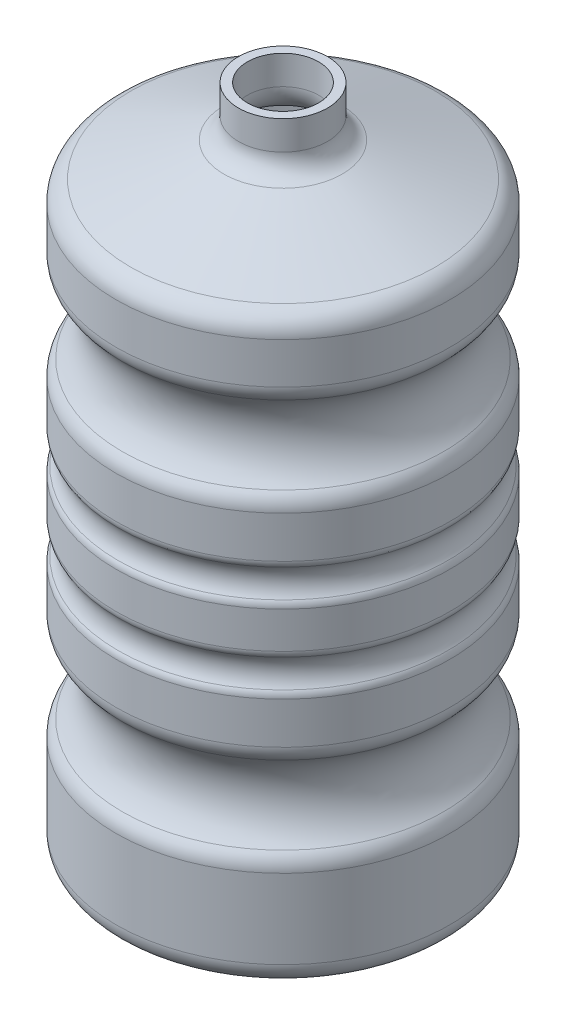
ISO-10303-21;
HEADER;
FILE_DESCRIPTION(('STEP AP214'),'2;1');
FILE_NAME('part.step','',(''),(''),'','','');
FILE_SCHEMA(('AUTOMOTIVE_DESIGN { 1 0 10303 214 1 1 1 1 }'));
ENDSEC;
DATA;
#1=APPLICATION_CONTEXT('core data for automotive mechanical design processes');
#2=APPLICATION_PROTOCOL_DEFINITION('international standard','automotive_design',2000,#1);
#3=PRODUCT_CONTEXT('',#1,'mechanical');
#4=PRODUCT('Part','Part','',(#3));
#5=PRODUCT_RELATED_PRODUCT_CATEGORY('part','',(#4));
#6=PRODUCT_DEFINITION_FORMATION('','',#4);
#7=PRODUCT_DEFINITION_CONTEXT('part definition',#1,'design');
#8=PRODUCT_DEFINITION('design','',#6,#7);
#9=PRODUCT_DEFINITION_SHAPE('','',#8);
#10=(LENGTH_UNIT() NAMED_UNIT(*) SI_UNIT(.MILLI.,.METRE.));
#11=(NAMED_UNIT(*) PLANE_ANGLE_UNIT() SI_UNIT($,.RADIAN.));
#12=(NAMED_UNIT(*) SI_UNIT($,.STERADIAN.) SOLID_ANGLE_UNIT());
#13=UNCERTAINTY_MEASURE_WITH_UNIT(LENGTH_MEASURE(1.E-05),#10,'distance_accuracy_value','');
#14=(GEOMETRIC_REPRESENTATION_CONTEXT(3) GLOBAL_UNCERTAINTY_ASSIGNED_CONTEXT((#13)) GLOBAL_UNIT_ASSIGNED_CONTEXT((#10,
#11,#12)) REPRESENTATION_CONTEXT('',''));
#15=CARTESIAN_POINT('',(0.,0.,0.));
#16=DIRECTION('',(0.,0.,1.));
#17=DIRECTION('',(1.,0.,0.));
#18=AXIS2_PLACEMENT_3D('',#15,#16,#17);
#19=CARTESIAN_POINT('',(0.,300.,0.));
#20=DIRECTION('',(0.,1.,0.));
#21=DIRECTION('',(0.,0.,1.));
#22=AXIS2_PLACEMENT_3D('',#19,#20,#21);
#23=PLANE('',#22);
#24=CARTESIAN_POINT('',(0.,300.,0.));
#25=DIRECTION('',(0.,1.,0.));
#26=DIRECTION('',(0.,0.,1.));
#27=AXIS2_PLACEMENT_3D('',#24,#25,#26);
#28=CIRCLE('',#27,16.);
#29=CARTESIAN_POINT('',(0.,300.,16.));
#30=VERTEX_POINT('',#29);
#31=EDGE_CURVE('E116',#30,#30,#28,.F.);
#32=ORIENTED_EDGE('',*,*,#31,.T.);
#33=EDGE_LOOP('',(#32));
#34=FACE_BOUND('',#33,.T.);
#35=CARTESIAN_POINT('',(0.,300.,0.));
#36=DIRECTION('',(0.,-1.,0.));
#37=DIRECTION('',(0.,0.,-1.));
#38=AXIS2_PLACEMENT_3D('',#35,#36,#37);
#39=CIRCLE('',#38,20.);
#40=CARTESIAN_POINT('',(0.,300.,-20.));
#41=VERTEX_POINT('',#40);
#42=EDGE_CURVE('E112',#41,#41,#39,.T.);
#43=ORIENTED_EDGE('',*,*,#42,.F.);
#44=EDGE_LOOP('',(#43));
#45=FACE_BOUND('',#44,.T.);
#46=ADVANCED_FACE('F35',(#34,#45),#23,.T.);
#47=CARTESIAN_POINT('',(0.,-75.,0.));
#48=DIRECTION('',(0.,-1.,0.));
#49=DIRECTION('',(0.,0.,-1.));
#50=AXIS2_PLACEMENT_3D('',#47,#48,#49);
#51=SPHERICAL_SURFACE('',#50,85.);
#52=CARTESIAN_POINT('',(0.,0.,0.));
#53=DIRECTION('',(0.,-1.,0.));
#54=DIRECTION('',(0.,0.,-1.));
#55=AXIS2_PLACEMENT_3D('',#52,#53,#54);
#56=CIRCLE('',#55,40.);
#57=CARTESIAN_POINT('',(0.,0.,-40.));
#58=VERTEX_POINT('',#57);
#59=EDGE_CURVE('E109',#58,#58,#56,.T.);
#60=ORIENTED_EDGE('',*,*,#59,.T.);
#61=EDGE_LOOP('',(#60));
#62=FACE_BOUND('',#61,.T.);
#63=ADVANCED_FACE('F203',(#62),#51,.F.);
#64=CARTESIAN_POINT('',(0.,0.,-75.));
#65=DIRECTION('',(0.,-1.,0.));
#66=DIRECTION('',(0.,0.,-1.));
#67=AXIS2_PLACEMENT_3D('',#64,#65,#66);
#68=PLANE('',#67);
#69=CARTESIAN_POINT('',(0.,0.,0.));
#70=DIRECTION('',(0.,-1.,0.));
#71=DIRECTION('',(0.,0.,-1.));
#72=AXIS2_PLACEMENT_3D('',#69,#70,#71);
#73=CIRCLE('',#72,65.);
#74=CARTESIAN_POINT('',(0.,0.,-65.));
#75=VERTEX_POINT('',#74);
#76=EDGE_CURVE('E76',#75,#75,#73,.T.);
#77=ORIENTED_EDGE('',*,*,#76,.T.);
#78=EDGE_LOOP('',(#77));
#79=FACE_BOUND('',#78,.T.);
#80=ORIENTED_EDGE('',*,*,#59,.F.);
#81=EDGE_LOOP('',(#80));
#82=FACE_BOUND('',#81,.T.);
#83=ADVANCED_FACE('F209',(#79,#82),#68,.T.);
#84=CARTESIAN_POINT('',(0.,10.,0.));
#85=DIRECTION('',(0.,-1.,0.));
#86=DIRECTION('',(0.,0.,-1.));
#87=AXIS2_PLACEMENT_3D('',#84,#85,#86);
#88=CYLINDRICAL_SURFACE('',#87,75.);
#89=CARTESIAN_POINT('',(0.,45.5051025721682,0.));
#90=DIRECTION('',(0.,1.,0.));
#91=DIRECTION('',(0.,0.,1.));
#92=AXIS2_PLACEMENT_3D('',#89,#90,#91);
#93=CIRCLE('',#92,75.);
#94=CARTESIAN_POINT('',(0.,45.5051025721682,75.));
#95=VERTEX_POINT('',#94);
#96=EDGE_CURVE('E103',#95,#95,#93,.F.);
#97=ORIENTED_EDGE('',*,*,#96,.T.);
#98=EDGE_LOOP('',(#97));
#99=FACE_BOUND('',#98,.T.);
#100=CARTESIAN_POINT('',(0.,10.,0.));
#101=DIRECTION('',(0.,-1.,0.));
#102=DIRECTION('',(0.,0.,-1.));
#103=AXIS2_PLACEMENT_3D('',#100,#101,#102);
#104=CIRCLE('',#103,75.);
#105=CARTESIAN_POINT('',(0.,10.,-75.));
#106=VERTEX_POINT('',#105);
#107=EDGE_CURVE('E106',#106,#106,#104,.F.);
#108=ORIENTED_EDGE('',*,*,#107,.T.);
#109=EDGE_LOOP('',(#108));
#110=FACE_BOUND('',#109,.T.);
#111=ADVANCED_FACE('F281',(#99,#110),#88,.T.);
#112=CARTESIAN_POINT('',(0.,70.,0.));
#113=DIRECTION('',(0.,-1.,0.));
#114=DIRECTION('',(0.,0.,-1.));
#115=AXIS2_PLACEMENT_3D('',#112,#113,#114);
#116=TOROIDAL_SURFACE('',#115,90.,25.);
#117=CARTESIAN_POINT('',(0.,52.5036446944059,0.));
#118=DIRECTION('',(0.,1.,0.));
#119=DIRECTION('',(0.,0.,1.));
#120=AXIS2_PLACEMENT_3D('',#117,#118,#119);
#121=CIRCLE('',#120,72.1428571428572);
#122=CARTESIAN_POINT('',(0.,52.5036446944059,72.1428571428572));
#123=VERTEX_POINT('',#122);
#124=EDGE_CURVE('E97',#123,#123,#121,.T.);
#125=ORIENTED_EDGE('',*,*,#124,.T.);
#126=EDGE_LOOP('',(#125));
#127=FACE_BOUND('',#126,.T.);
#128=CARTESIAN_POINT('',(0.,87.4963553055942,0.));
#129=DIRECTION('',(0.,-1.,0.));
#130=DIRECTION('',(0.,0.,-1.));
#131=AXIS2_PLACEMENT_3D('',#128,#129,#130);
#132=CIRCLE('',#131,72.1428571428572);
#133=CARTESIAN_POINT('',(0.,87.4963553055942,-72.1428571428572));
#134=VERTEX_POINT('',#133);
#135=EDGE_CURVE('E100',#134,#134,#132,.T.);
#136=ORIENTED_EDGE('',*,*,#135,.T.);
#137=EDGE_LOOP('',(#136));
#138=FACE_BOUND('',#137,.T.);
#139=ADVANCED_FACE('F277',(#127,#138),#116,.F.);
#140=CARTESIAN_POINT('',(0.,10.,0.));
#141=DIRECTION('',(0.,-1.,0.));
#142=DIRECTION('',(0.,0.,-1.));
#143=AXIS2_PLACEMENT_3D('',#140,#141,#142);
#144=CYLINDRICAL_SURFACE('',#143,75.);
#145=CARTESIAN_POINT('',(0.,113.212912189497,0.));
#146=DIRECTION('',(0.,1.,0.));
#147=DIRECTION('',(0.,0.,1.));
#148=AXIS2_PLACEMENT_3D('',#145,#146,#147);
#149=CIRCLE('',#148,75.);
#150=CARTESIAN_POINT('',(0.,113.212912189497,75.));
#151=VERTEX_POINT('',#150);
#152=EDGE_CURVE('E64',#151,#151,#149,.F.);
#153=ORIENTED_EDGE('',*,*,#152,.T.);
#154=EDGE_LOOP('',(#153));
#155=FACE_BOUND('',#154,.T.);
#156=CARTESIAN_POINT('',(0.,94.4948974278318,0.));
#157=DIRECTION('',(0.,1.,0.));
#158=DIRECTION('',(0.,0.,1.));
#159=AXIS2_PLACEMENT_3D('',#156,#157,#158);
#160=CIRCLE('',#159,75.);
#161=CARTESIAN_POINT('',(0.,94.4948974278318,75.));
#162=VERTEX_POINT('',#161);
#163=EDGE_CURVE('E94',#162,#162,#160,.T.);
#164=ORIENTED_EDGE('',*,*,#163,.T.);
#165=EDGE_LOOP('',(#164));
#166=FACE_BOUND('',#165,.T.);
#167=ADVANCED_FACE('F270',(#155,#166),#144,.T.);
#168=CARTESIAN_POINT('',(0.,122.5,0.));
#169=DIRECTION('',(0.,-1.,0.));
#170=DIRECTION('',(0.,0.,-1.));
#171=AXIS2_PLACEMENT_3D('',#168,#169,#170);
#172=TOROIDAL_SURFACE('',#171,82.875,10.875);
#173=CARTESIAN_POINT('',(0.,116.137979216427,0.));
#174=DIRECTION('',(0.,1.,0.));
#175=DIRECTION('',(0.,0.,1.));
#176=AXIS2_PLACEMENT_3D('',#173,#174,#175);
#177=CIRCLE('',#176,74.0551181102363);
#178=CARTESIAN_POINT('',(0.,116.137979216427,74.0551181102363));
#179=VERTEX_POINT('',#178);
#180=EDGE_CURVE('E58',#179,#179,#177,.T.);
#181=ORIENTED_EDGE('',*,*,#180,.T.);
#182=EDGE_LOOP('',(#181));
#183=FACE_BOUND('',#182,.T.);
#184=CARTESIAN_POINT('',(0.,128.862020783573,0.));
#185=DIRECTION('',(0.,-1.,0.));
#186=DIRECTION('',(0.,0.,-1.));
#187=AXIS2_PLACEMENT_3D('',#184,#185,#186);
#188=CIRCLE('',#187,74.0551181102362);
#189=CARTESIAN_POINT('',(0.,128.862020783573,-74.0551181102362));
#190=VERTEX_POINT('',#189);
#191=EDGE_CURVE('E61',#190,#190,#188,.T.);
#192=ORIENTED_EDGE('',*,*,#191,.T.);
#193=EDGE_LOOP('',(#192));
#194=FACE_BOUND('',#193,.T.);
#195=ADVANCED_FACE('F261',(#183,#194),#172,.F.);
#196=CARTESIAN_POINT('',(0.,10.,0.));
#197=DIRECTION('',(0.,-1.,0.));
#198=DIRECTION('',(0.,0.,-1.));
#199=AXIS2_PLACEMENT_3D('',#196,#197,#198);
#200=CYLINDRICAL_SURFACE('',#199,75.);
#201=CARTESIAN_POINT('',(0.,131.787087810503,0.));
#202=DIRECTION('',(0.,1.,0.));
#203=DIRECTION('',(0.,0.,1.));
#204=AXIS2_PLACEMENT_3D('',#201,#202,#203);
#205=CIRCLE('',#204,75.);
#206=CARTESIAN_POINT('',(0.,131.787087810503,75.));
#207=VERTEX_POINT('',#206);
#208=EDGE_CURVE('E50',#207,#207,#205,.T.);
#209=ORIENTED_EDGE('',*,*,#208,.T.);
#210=EDGE_LOOP('',(#209));
#211=FACE_BOUND('',#210,.T.);
#212=CARTESIAN_POINT('',(0.,148.212912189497,0.));
#213=DIRECTION('',(0.,1.,0.));
#214=DIRECTION('',(0.,0.,1.));
#215=AXIS2_PLACEMENT_3D('',#212,#213,#214);
#216=CIRCLE('',#215,75.);
#217=CARTESIAN_POINT('',(0.,148.212912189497,75.));
#218=VERTEX_POINT('',#217);
#219=EDGE_CURVE('E55',#218,#218,#216,.F.);
#220=ORIENTED_EDGE('',*,*,#219,.T.);
#221=EDGE_LOOP('',(#220));
#222=FACE_BOUND('',#221,.T.);
#223=ADVANCED_FACE('F258',(#211,#222),#200,.T.);
#224=CARTESIAN_POINT('',(0.,157.5,0.));
#225=DIRECTION('',(0.,-1.,0.));
#226=DIRECTION('',(0.,0.,-1.));
#227=AXIS2_PLACEMENT_3D('',#224,#225,#226);
#228=TOROIDAL_SURFACE('',#227,82.875,10.875);
#229=CARTESIAN_POINT('',(0.,151.137979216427,0.));
#230=DIRECTION('',(0.,1.,0.));
#231=DIRECTION('',(0.,0.,1.));
#232=AXIS2_PLACEMENT_3D('',#229,#230,#231);
#233=CIRCLE('',#232,74.0551181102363);
#234=CARTESIAN_POINT('',(0.,151.137979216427,74.0551181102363));
#235=VERTEX_POINT('',#234);
#236=EDGE_CURVE('E42',#235,#235,#233,.T.);
#237=ORIENTED_EDGE('',*,*,#236,.T.);
#238=EDGE_LOOP('',(#237));
#239=FACE_BOUND('',#238,.T.);
#240=CARTESIAN_POINT('',(0.,163.862020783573,0.));
#241=DIRECTION('',(0.,-1.,0.));
#242=DIRECTION('',(0.,0.,-1.));
#243=AXIS2_PLACEMENT_3D('',#240,#241,#242);
#244=CIRCLE('',#243,74.0551181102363);
#245=CARTESIAN_POINT('',(0.,163.862020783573,-74.0551181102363));
#246=VERTEX_POINT('',#245);
#247=EDGE_CURVE('E46',#246,#246,#244,.T.);
#248=ORIENTED_EDGE('',*,*,#247,.T.);
#249=EDGE_LOOP('',(#248));
#250=FACE_BOUND('',#249,.T.);
#251=ADVANCED_FACE('F260',(#239,#250),#228,.F.);
#252=CARTESIAN_POINT('',(0.,10.,0.));
#253=DIRECTION('',(0.,-1.,0.));
#254=DIRECTION('',(0.,0.,-1.));
#255=AXIS2_PLACEMENT_3D('',#252,#253,#254);
#256=CYLINDRICAL_SURFACE('',#255,75.);
#257=CARTESIAN_POINT('',(0.,166.787087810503,0.));
#258=DIRECTION('',(0.,1.,0.));
#259=DIRECTION('',(0.,0.,1.));
#260=AXIS2_PLACEMENT_3D('',#257,#258,#259);
#261=CIRCLE('',#260,75.);
#262=CARTESIAN_POINT('',(0.,166.787087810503,75.));
#263=VERTEX_POINT('',#262);
#264=EDGE_CURVE('E10',#263,#263,#261,.T.);
#265=ORIENTED_EDGE('',*,*,#264,.T.);
#266=EDGE_LOOP('',(#265));
#267=FACE_BOUND('',#266,.T.);
#268=CARTESIAN_POINT('',(0.,185.505102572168,0.));
#269=DIRECTION('',(0.,1.,0.));
#270=DIRECTION('',(0.,0.,1.));
#271=AXIS2_PLACEMENT_3D('',#268,#269,#270);
#272=CIRCLE('',#271,75.);
#273=CARTESIAN_POINT('',(0.,185.505102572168,75.));
#274=VERTEX_POINT('',#273);
#275=EDGE_CURVE('E91',#274,#274,#272,.F.);
#276=ORIENTED_EDGE('',*,*,#275,.T.);
#277=EDGE_LOOP('',(#276));
#278=FACE_BOUND('',#277,.T.);
#279=ADVANCED_FACE('F268',(#267,#278),#256,.T.);
#280=CARTESIAN_POINT('',(0.,210.,0.));
#281=DIRECTION('',(0.,-1.,0.));
#282=DIRECTION('',(0.,0.,-1.));
#283=AXIS2_PLACEMENT_3D('',#280,#281,#282);
#284=TOROIDAL_SURFACE('',#283,90.,25.);
#285=CARTESIAN_POINT('',(0.,192.503644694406,0.));
#286=DIRECTION('',(0.,1.,0.));
#287=DIRECTION('',(0.,0.,1.));
#288=AXIS2_PLACEMENT_3D('',#285,#286,#287);
#289=CIRCLE('',#288,72.1428571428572);
#290=CARTESIAN_POINT('',(0.,192.503644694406,72.1428571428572));
#291=VERTEX_POINT('',#290);
#292=EDGE_CURVE('E85',#291,#291,#289,.T.);
#293=ORIENTED_EDGE('',*,*,#292,.T.);
#294=EDGE_LOOP('',(#293));
#295=FACE_BOUND('',#294,.T.);
#296=CARTESIAN_POINT('',(0.,227.496355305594,0.));
#297=DIRECTION('',(0.,-1.,0.));
#298=DIRECTION('',(0.,0.,-1.));
#299=AXIS2_PLACEMENT_3D('',#296,#297,#298);
#300=CIRCLE('',#299,72.1428571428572);
#301=CARTESIAN_POINT('',(0.,227.496355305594,-72.1428571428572));
#302=VERTEX_POINT('',#301);
#303=EDGE_CURVE('E88',#302,#302,#300,.T.);
#304=ORIENTED_EDGE('',*,*,#303,.T.);
#305=EDGE_LOOP('',(#304));
#306=FACE_BOUND('',#305,.T.);
#307=ADVANCED_FACE('F332',(#295,#306),#284,.F.);
#308=CARTESIAN_POINT('',(0.,10.,0.));
#309=DIRECTION('',(0.,-1.,0.));
#310=DIRECTION('',(0.,0.,-1.));
#311=AXIS2_PLACEMENT_3D('',#308,#309,#310);
#312=CYLINDRICAL_SURFACE('',#311,75.);
#313=CARTESIAN_POINT('',(0.,234.494897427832,0.));
#314=DIRECTION('',(0.,1.,0.));
#315=DIRECTION('',(0.,0.,1.));
#316=AXIS2_PLACEMENT_3D('',#313,#314,#315);
#317=CIRCLE('',#316,75.);
#318=CARTESIAN_POINT('',(0.,234.494897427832,75.));
#319=VERTEX_POINT('',#318);
#320=EDGE_CURVE('E79',#319,#319,#317,.T.);
#321=ORIENTED_EDGE('',*,*,#320,.T.);
#322=EDGE_LOOP('',(#321));
#323=FACE_BOUND('',#322,.T.);
#324=CARTESIAN_POINT('',(0.,252.979561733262,0.));
#325=DIRECTION('',(0.,1.,0.));
#326=DIRECTION('',(0.,0.,1.));
#327=AXIS2_PLACEMENT_3D('',#324,#325,#326);
#328=CIRCLE('',#327,75.);
#329=CARTESIAN_POINT('',(0.,252.979561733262,75.));
#330=VERTEX_POINT('',#329);
#331=EDGE_CURVE('E82',#330,#330,#328,.F.);
#332=ORIENTED_EDGE('',*,*,#331,.T.);
#333=EDGE_LOOP('',(#332));
#334=FACE_BOUND('',#333,.T.);
#335=ADVANCED_FACE('F602',(#323,#334),#312,.T.);
#336=CARTESIAN_POINT('',(0.,259.981637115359,0.));
#337=DIRECTION('',(0.,-1.,0.));
#338=DIRECTION('',(0.,0.,-1.));
#339=AXIS2_PLACEMENT_3D('',#336,#337,#338);
#340=CONICAL_SURFACE('',#339,75.,1.22173047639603);
#341=CARTESIAN_POINT('',(0.,262.376487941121,0.));
#342=DIRECTION('',(0.,1.,0.));
#343=DIRECTION('',(0.,0.,1.));
#344=AXIS2_PLACEMENT_3D('',#341,#342,#343);
#345=CIRCLE('',#344,68.4202014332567);
#346=CARTESIAN_POINT('',(0.,262.376487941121,68.4202014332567));
#347=VERTEX_POINT('',#346);
#348=EDGE_CURVE('E70',#347,#347,#345,.T.);
#349=ORIENTED_EDGE('',*,*,#348,.T.);
#350=EDGE_LOOP('',(#349));
#351=FACE_BOUND('',#350,.T.);
#352=CARTESIAN_POINT('',(0.,277.605149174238,0.));
#353=DIRECTION('',(0.,-1.,0.));
#354=DIRECTION('',(0.,0.,-1.));
#355=AXIS2_PLACEMENT_3D('',#352,#353,#354);
#356=CIRCLE('',#355,26.5797985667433);
#357=CARTESIAN_POINT('',(0.,277.605149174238,-26.5797985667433));
#358=VERTEX_POINT('',#357);
#359=EDGE_CURVE('E73',#358,#358,#356,.T.);
#360=ORIENTED_EDGE('',*,*,#359,.T.);
#361=EDGE_LOOP('',(#360));
#362=FACE_BOUND('',#361,.T.);
#363=ADVANCED_FACE('F598',(#351,#362),#340,.T.);
#364=CARTESIAN_POINT('',(0.,10.,0.));
#365=DIRECTION('',(0.,-1.,0.));
#366=DIRECTION('',(0.,0.,-1.));
#367=AXIS2_PLACEMENT_3D('',#364,#365,#366);
#368=CYLINDRICAL_SURFACE('',#367,20.);
#369=CARTESIAN_POINT('',(0.,287.002075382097,0.));
#370=DIRECTION('',(0.,-1.,0.));
#371=DIRECTION('',(0.,0.,-1.));
#372=AXIS2_PLACEMENT_3D('',#369,#370,#371);
#373=CIRCLE('',#372,20.);
#374=CARTESIAN_POINT('',(0.,287.002075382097,-20.));
#375=VERTEX_POINT('',#374);
#376=EDGE_CURVE('E67',#375,#375,#373,.F.);
#377=ORIENTED_EDGE('',*,*,#376,.T.);
#378=EDGE_LOOP('',(#377));
#379=FACE_BOUND('',#378,.T.);
#380=ORIENTED_EDGE('',*,*,#42,.T.);
#381=EDGE_LOOP('',(#380));
#382=FACE_BOUND('',#381,.T.);
#383=ADVANCED_FACE('F219',(#379,#382),#368,.T.);
#384=CARTESIAN_POINT('',(0.,45.5051025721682,0.));
#385=DIRECTION('',(0.,1.,0.));
#386=DIRECTION('',(0.,0.,1.));
#387=AXIS2_PLACEMENT_3D('',#384,#385,#386);
#388=TOROIDAL_SURFACE('',#387,65.,10.);
#389=ORIENTED_EDGE('',*,*,#124,.F.);
#390=EDGE_LOOP('',(#389));
#391=FACE_BOUND('',#390,.T.);
#392=ORIENTED_EDGE('',*,*,#96,.F.);
#393=EDGE_LOOP('',(#392));
#394=FACE_BOUND('',#393,.T.);
#395=ADVANCED_FACE('F215',(#391,#394),#388,.T.);
#396=CARTESIAN_POINT('',(0.,94.4948974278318,0.));
#397=DIRECTION('',(0.,1.,0.));
#398=DIRECTION('',(0.,0.,1.));
#399=AXIS2_PLACEMENT_3D('',#396,#397,#398);
#400=TOROIDAL_SURFACE('',#399,65.,10.);
#401=ORIENTED_EDGE('',*,*,#163,.F.);
#402=EDGE_LOOP('',(#401));
#403=FACE_BOUND('',#402,.T.);
#404=ORIENTED_EDGE('',*,*,#135,.F.);
#405=EDGE_LOOP('',(#404));
#406=FACE_BOUND('',#405,.T.);
#407=ADVANCED_FACE('F218',(#403,#406),#400,.T.);
#408=CARTESIAN_POINT('',(0.,185.505102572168,0.));
#409=DIRECTION('',(0.,1.,0.));
#410=DIRECTION('',(0.,0.,1.));
#411=AXIS2_PLACEMENT_3D('',#408,#409,#410);
#412=TOROIDAL_SURFACE('',#411,65.,10.);
#413=ORIENTED_EDGE('',*,*,#292,.F.);
#414=EDGE_LOOP('',(#413));
#415=FACE_BOUND('',#414,.T.);
#416=ORIENTED_EDGE('',*,*,#275,.F.);
#417=EDGE_LOOP('',(#416));
#418=FACE_BOUND('',#417,.T.);
#419=ADVANCED_FACE('F223',(#415,#418),#412,.T.);
#420=CARTESIAN_POINT('',(0.,234.494897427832,0.));
#421=DIRECTION('',(0.,1.,0.));
#422=DIRECTION('',(0.,0.,1.));
#423=AXIS2_PLACEMENT_3D('',#420,#421,#422);
#424=TOROIDAL_SURFACE('',#423,65.,10.);
#425=ORIENTED_EDGE('',*,*,#320,.F.);
#426=EDGE_LOOP('',(#425));
#427=FACE_BOUND('',#426,.T.);
#428=ORIENTED_EDGE('',*,*,#303,.F.);
#429=EDGE_LOOP('',(#428));
#430=FACE_BOUND('',#429,.T.);
#431=ADVANCED_FACE('F227',(#427,#430),#424,.T.);
#432=CARTESIAN_POINT('',(0.,10.,0.));
#433=DIRECTION('',(0.,-1.,0.));
#434=DIRECTION('',(0.,0.,-1.));
#435=AXIS2_PLACEMENT_3D('',#432,#433,#434);
#436=TOROIDAL_SURFACE('',#435,65.,10.);
#437=ORIENTED_EDGE('',*,*,#107,.F.);
#438=EDGE_LOOP('',(#437));
#439=FACE_BOUND('',#438,.T.);
#440=ORIENTED_EDGE('',*,*,#76,.F.);
#441=EDGE_LOOP('',(#440));
#442=FACE_BOUND('',#441,.T.);
#443=ADVANCED_FACE('F231',(#439,#442),#436,.T.);
#444=CARTESIAN_POINT('',(0.,252.979561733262,0.));
#445=DIRECTION('',(0.,1.,0.));
#446=DIRECTION('',(0.,0.,1.));
#447=AXIS2_PLACEMENT_3D('',#444,#445,#446);
#448=TOROIDAL_SURFACE('',#447,65.,10.);
#449=ORIENTED_EDGE('',*,*,#348,.F.);
#450=EDGE_LOOP('',(#449));
#451=FACE_BOUND('',#450,.T.);
#452=ORIENTED_EDGE('',*,*,#331,.F.);
#453=EDGE_LOOP('',(#452));
#454=FACE_BOUND('',#453,.T.);
#455=ADVANCED_FACE('F235',(#451,#454),#448,.T.);
#456=CARTESIAN_POINT('',(0.,287.002075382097,0.));
#457=DIRECTION('',(0.,-1.,0.));
#458=DIRECTION('',(0.,0.,-1.));
#459=AXIS2_PLACEMENT_3D('',#456,#457,#458);
#460=TOROIDAL_SURFACE('',#459,30.,10.);
#461=ORIENTED_EDGE('',*,*,#376,.F.);
#462=EDGE_LOOP('',(#461));
#463=FACE_BOUND('',#462,.T.);
#464=ORIENTED_EDGE('',*,*,#359,.F.);
#465=EDGE_LOOP('',(#464));
#466=FACE_BOUND('',#465,.T.);
#467=ADVANCED_FACE('F239',(#463,#466),#460,.F.);
#468=CARTESIAN_POINT('',(0.,113.212912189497,0.));
#469=DIRECTION('',(0.,1.,0.));
#470=DIRECTION('',(0.,0.,1.));
#471=AXIS2_PLACEMENT_3D('',#468,#469,#470);
#472=TOROIDAL_SURFACE('',#471,70.,5.);
#473=ORIENTED_EDGE('',*,*,#180,.F.);
#474=EDGE_LOOP('',(#473));
#475=FACE_BOUND('',#474,.T.);
#476=ORIENTED_EDGE('',*,*,#152,.F.);
#477=EDGE_LOOP('',(#476));
#478=FACE_BOUND('',#477,.T.);
#479=ADVANCED_FACE('F243',(#475,#478),#472,.T.);
#480=CARTESIAN_POINT('',(0.,131.787087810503,0.));
#481=DIRECTION('',(0.,1.,0.));
#482=DIRECTION('',(0.,0.,1.));
#483=AXIS2_PLACEMENT_3D('',#480,#481,#482);
#484=TOROIDAL_SURFACE('',#483,70.,5.);
#485=ORIENTED_EDGE('',*,*,#208,.F.);
#486=EDGE_LOOP('',(#485));
#487=FACE_BOUND('',#486,.T.);
#488=ORIENTED_EDGE('',*,*,#191,.F.);
#489=EDGE_LOOP('',(#488));
#490=FACE_BOUND('',#489,.T.);
#491=ADVANCED_FACE('F247',(#487,#490),#484,.T.);
#492=CARTESIAN_POINT('',(0.,148.212912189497,0.));
#493=DIRECTION('',(0.,1.,0.));
#494=DIRECTION('',(0.,0.,1.));
#495=AXIS2_PLACEMENT_3D('',#492,#493,#494);
#496=TOROIDAL_SURFACE('',#495,70.,5.);
#497=ORIENTED_EDGE('',*,*,#236,.F.);
#498=EDGE_LOOP('',(#497));
#499=FACE_BOUND('',#498,.T.);
#500=ORIENTED_EDGE('',*,*,#219,.F.);
#501=EDGE_LOOP('',(#500));
#502=FACE_BOUND('',#501,.T.);
#503=ADVANCED_FACE('F200',(#499,#502),#496,.T.);
#504=CARTESIAN_POINT('',(0.,166.787087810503,0.));
#505=DIRECTION('',(0.,1.,0.));
#506=DIRECTION('',(0.,0.,1.));
#507=AXIS2_PLACEMENT_3D('',#504,#505,#506);
#508=TOROIDAL_SURFACE('',#507,70.,5.);
#509=ORIENTED_EDGE('',*,*,#264,.F.);
#510=EDGE_LOOP('',(#509));
#511=FACE_BOUND('',#510,.T.);
#512=ORIENTED_EDGE('',*,*,#247,.F.);
#513=EDGE_LOOP('',(#512));
#514=FACE_BOUND('',#513,.T.);
#515=ADVANCED_FACE('F37',(#511,#514),#508,.T.);
#516=CARTESIAN_POINT('',(0.,-75.,0.));
#517=DIRECTION('',(0.,-1.,0.));
#518=DIRECTION('',(0.,0.,-1.));
#519=AXIS2_PLACEMENT_3D('',#516,#517,#518);
#520=SPHERICAL_SURFACE('',#519,89.);
#521=CARTESIAN_POINT('',(0.,4.,0.));
#522=DIRECTION('',(0.,-1.,0.));
#523=DIRECTION('',(0.,0.,-1.));
#524=AXIS2_PLACEMENT_3D('',#521,#522,#523);
#525=CIRCLE('',#524,40.9878030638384);
#526=CARTESIAN_POINT('',(0.,4.,-40.9878030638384));
#527=VERTEX_POINT('',#526);
#528=EDGE_CURVE('E119',#527,#527,#525,.T.);
#529=ORIENTED_EDGE('',*,*,#528,.F.);
#530=EDGE_LOOP('',(#529));
#531=FACE_BOUND('',#530,.T.);
#532=ADVANCED_FACE('F190',(#531),#520,.T.);
#533=CARTESIAN_POINT('',(0.,4.,-75.));
#534=DIRECTION('',(0.,-1.,0.));
#535=DIRECTION('',(0.,0.,-1.));
#536=AXIS2_PLACEMENT_3D('',#533,#534,#535);
#537=PLANE('',#536);
#538=CARTESIAN_POINT('',(0.,4.,0.));
#539=DIRECTION('',(0.,-1.,0.));
#540=DIRECTION('',(0.,0.,-1.));
#541=AXIS2_PLACEMENT_3D('',#538,#539,#540);
#542=CIRCLE('',#541,65.);
#543=CARTESIAN_POINT('',(0.,4.,-65.));
#544=VERTEX_POINT('',#543);
#545=EDGE_CURVE('E128',#544,#544,#542,.T.);
#546=ORIENTED_EDGE('',*,*,#545,.F.);
#547=EDGE_LOOP('',(#546));
#548=FACE_BOUND('',#547,.T.);
#549=ORIENTED_EDGE('',*,*,#528,.T.);
#550=EDGE_LOOP('',(#549));
#551=FACE_BOUND('',#550,.T.);
#552=ADVANCED_FACE('F188',(#548,#551),#537,.F.);
#553=CARTESIAN_POINT('',(0.,10.,0.));
#554=DIRECTION('',(0.,-1.,0.));
#555=DIRECTION('',(0.,0.,-1.));
#556=AXIS2_PLACEMENT_3D('',#553,#554,#555);
#557=CYLINDRICAL_SURFACE('',#556,71.);
#558=CARTESIAN_POINT('',(0.,45.5051025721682,0.));
#559=DIRECTION('',(0.,-1.,0.));
#560=DIRECTION('',(0.,0.,-1.));
#561=AXIS2_PLACEMENT_3D('',#558,#559,#560);
#562=CIRCLE('',#561,71.);
#563=CARTESIAN_POINT('',(0.,45.5051025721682,-71.));
#564=VERTEX_POINT('',#563);
#565=EDGE_CURVE('E175',#564,#564,#562,.T.);
#566=ORIENTED_EDGE('',*,*,#565,.F.);
#567=EDGE_LOOP('',(#566));
#568=FACE_BOUND('',#567,.T.);
#569=CARTESIAN_POINT('',(0.,10.,0.));
#570=DIRECTION('',(0.,-1.,0.));
#571=DIRECTION('',(0.,0.,-1.));
#572=AXIS2_PLACEMENT_3D('',#569,#570,#571);
#573=CIRCLE('',#572,71.);
#574=CARTESIAN_POINT('',(0.,10.,-71.));
#575=VERTEX_POINT('',#574);
#576=EDGE_CURVE('E180',#575,#575,#573,.F.);
#577=ORIENTED_EDGE('',*,*,#576,.F.);
#578=EDGE_LOOP('',(#577));
#579=FACE_BOUND('',#578,.T.);
#580=ADVANCED_FACE('F197',(#568,#579),#557,.F.);
#581=CARTESIAN_POINT('',(0.,70.,0.));
#582=DIRECTION('',(0.,-1.,0.));
#583=DIRECTION('',(0.,0.,-1.));
#584=AXIS2_PLACEMENT_3D('',#581,#582,#583);
#585=TOROIDAL_SURFACE('',#584,90.,29.);
#586=CARTESIAN_POINT('',(0.,49.7042278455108,0.));
#587=DIRECTION('',(0.,-1.,0.));
#588=DIRECTION('',(0.,0.,-1.));
#589=AXIS2_PLACEMENT_3D('',#586,#587,#588);
#590=CIRCLE('',#589,69.2857142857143);
#591=CARTESIAN_POINT('',(0.,49.7042278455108,-69.2857142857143));
#592=VERTEX_POINT('',#591);
#593=EDGE_CURVE('E171',#592,#592,#590,.F.);
#594=ORIENTED_EDGE('',*,*,#593,.F.);
#595=EDGE_LOOP('',(#594));
#596=FACE_BOUND('',#595,.T.);
#597=CARTESIAN_POINT('',(0.,90.2957721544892,0.));
#598=DIRECTION('',(0.,-1.,0.));
#599=DIRECTION('',(0.,0.,-1.));
#600=AXIS2_PLACEMENT_3D('',#597,#598,#599);
#601=CIRCLE('',#600,69.2857142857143);
#602=CARTESIAN_POINT('',(0.,90.2957721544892,-69.2857142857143));
#603=VERTEX_POINT('',#602);
#604=EDGE_CURVE('E172',#603,#603,#601,.T.);
#605=ORIENTED_EDGE('',*,*,#604,.F.);
#606=EDGE_LOOP('',(#605));
#607=FACE_BOUND('',#606,.T.);
#608=ADVANCED_FACE('F380',(#596,#607),#585,.T.);
#609=CARTESIAN_POINT('',(0.,10.,0.));
#610=DIRECTION('',(0.,-1.,0.));
#611=DIRECTION('',(0.,0.,-1.));
#612=AXIS2_PLACEMENT_3D('',#609,#610,#611);
#613=CYLINDRICAL_SURFACE('',#612,71.);
#614=CARTESIAN_POINT('',(0.,113.212912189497,0.));
#615=DIRECTION('',(0.,-1.,0.));
#616=DIRECTION('',(0.,0.,-1.));
#617=AXIS2_PLACEMENT_3D('',#614,#615,#616);
#618=CIRCLE('',#617,71.);
#619=CARTESIAN_POINT('',(0.,113.212912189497,-71.));
#620=VERTEX_POINT('',#619);
#621=EDGE_CURVE('E123',#620,#620,#618,.T.);
#622=ORIENTED_EDGE('',*,*,#621,.F.);
#623=EDGE_LOOP('',(#622));
#624=FACE_BOUND('',#623,.T.);
#625=CARTESIAN_POINT('',(0.,94.4948974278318,0.));
#626=DIRECTION('',(0.,-1.,0.));
#627=DIRECTION('',(0.,0.,-1.));
#628=AXIS2_PLACEMENT_3D('',#625,#626,#627);
#629=CIRCLE('',#628,71.);
#630=CARTESIAN_POINT('',(0.,94.4948974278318,-71.));
#631=VERTEX_POINT('',#630);
#632=EDGE_CURVE('E146',#631,#631,#629,.F.);
#633=ORIENTED_EDGE('',*,*,#632,.F.);
#634=EDGE_LOOP('',(#633));
#635=FACE_BOUND('',#634,.T.);
#636=ADVANCED_FACE('F390',(#624,#635),#613,.F.);
#637=CARTESIAN_POINT('',(0.,122.5,0.));
#638=DIRECTION('',(0.,-1.,0.));
#639=DIRECTION('',(0.,0.,-1.));
#640=AXIS2_PLACEMENT_3D('',#637,#638,#639);
#641=TOROIDAL_SURFACE('',#640,82.875,14.875);
#642=CARTESIAN_POINT('',(0.,113.797925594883,0.));
#643=DIRECTION('',(0.,-1.,0.));
#644=DIRECTION('',(0.,0.,-1.));
#645=AXIS2_PLACEMENT_3D('',#642,#643,#644);
#646=CIRCLE('',#645,70.8110236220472);
#647=CARTESIAN_POINT('',(0.,113.797925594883,-70.8110236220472));
#648=VERTEX_POINT('',#647);
#649=EDGE_CURVE('E159',#648,#648,#646,.F.);
#650=ORIENTED_EDGE('',*,*,#649,.F.);
#651=EDGE_LOOP('',(#650));
#652=FACE_BOUND('',#651,.T.);
#653=CARTESIAN_POINT('',(0.,131.202074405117,0.));
#654=DIRECTION('',(0.,-1.,0.));
#655=DIRECTION('',(0.,0.,-1.));
#656=AXIS2_PLACEMENT_3D('',#653,#654,#655);
#657=CIRCLE('',#656,70.8110236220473);
#658=CARTESIAN_POINT('',(0.,131.202074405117,-70.8110236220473));
#659=VERTEX_POINT('',#658);
#660=EDGE_CURVE('E162',#659,#659,#657,.T.);
#661=ORIENTED_EDGE('',*,*,#660,.F.);
#662=EDGE_LOOP('',(#661));
#663=FACE_BOUND('',#662,.T.);
#664=ADVANCED_FACE('F400',(#652,#663),#641,.T.);
#665=CARTESIAN_POINT('',(0.,10.,0.));
#666=DIRECTION('',(0.,-1.,0.));
#667=DIRECTION('',(0.,0.,-1.));
#668=AXIS2_PLACEMENT_3D('',#665,#666,#667);
#669=CYLINDRICAL_SURFACE('',#668,71.);
#670=CARTESIAN_POINT('',(0.,131.787087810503,0.));
#671=DIRECTION('',(0.,-1.,0.));
#672=DIRECTION('',(0.,0.,-1.));
#673=AXIS2_PLACEMENT_3D('',#670,#671,#672);
#674=CIRCLE('',#673,71.);
#675=CARTESIAN_POINT('',(0.,131.787087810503,-71.));
#676=VERTEX_POINT('',#675);
#677=EDGE_CURVE('E153',#676,#676,#674,.F.);
#678=ORIENTED_EDGE('',*,*,#677,.F.);
#679=EDGE_LOOP('',(#678));
#680=FACE_BOUND('',#679,.T.);
#681=CARTESIAN_POINT('',(0.,148.212912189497,0.));
#682=DIRECTION('',(0.,-1.,0.));
#683=DIRECTION('',(0.,0.,-1.));
#684=AXIS2_PLACEMENT_3D('',#681,#682,#683);
#685=CIRCLE('',#684,71.);
#686=CARTESIAN_POINT('',(0.,148.212912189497,-71.));
#687=VERTEX_POINT('',#686);
#688=EDGE_CURVE('E156',#687,#687,#685,.T.);
#689=ORIENTED_EDGE('',*,*,#688,.F.);
#690=EDGE_LOOP('',(#689));
#691=FACE_BOUND('',#690,.T.);
#692=ADVANCED_FACE('F410',(#680,#691),#669,.F.);
#693=CARTESIAN_POINT('',(0.,157.5,0.));
#694=DIRECTION('',(0.,-1.,0.));
#695=DIRECTION('',(0.,0.,-1.));
#696=AXIS2_PLACEMENT_3D('',#693,#694,#695);
#697=TOROIDAL_SURFACE('',#696,82.875,14.875);
#698=CARTESIAN_POINT('',(0.,148.797925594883,0.));
#699=DIRECTION('',(0.,-1.,0.));
#700=DIRECTION('',(0.,0.,-1.));
#701=AXIS2_PLACEMENT_3D('',#698,#699,#700);
#702=CIRCLE('',#701,70.8110236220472);
#703=CARTESIAN_POINT('',(0.,148.797925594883,-70.8110236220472));
#704=VERTEX_POINT('',#703);
#705=EDGE_CURVE('E149',#704,#704,#702,.F.);
#706=ORIENTED_EDGE('',*,*,#705,.F.);
#707=EDGE_LOOP('',(#706));
#708=FACE_BOUND('',#707,.T.);
#709=CARTESIAN_POINT('',(0.,166.202074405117,0.));
#710=DIRECTION('',(0.,-1.,0.));
#711=DIRECTION('',(0.,0.,-1.));
#712=AXIS2_PLACEMENT_3D('',#709,#710,#711);
#713=CIRCLE('',#712,70.8110236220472);
#714=CARTESIAN_POINT('',(0.,166.202074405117,-70.8110236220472));
#715=VERTEX_POINT('',#714);
#716=EDGE_CURVE('E150',#715,#715,#713,.T.);
#717=ORIENTED_EDGE('',*,*,#716,.F.);
#718=EDGE_LOOP('',(#717));
#719=FACE_BOUND('',#718,.T.);
#720=ADVANCED_FACE('F420',(#708,#719),#697,.T.);
#721=CARTESIAN_POINT('',(0.,10.,0.));
#722=DIRECTION('',(0.,-1.,0.));
#723=DIRECTION('',(0.,0.,-1.));
#724=AXIS2_PLACEMENT_3D('',#721,#722,#723);
#725=CYLINDRICAL_SURFACE('',#724,71.);
#726=CARTESIAN_POINT('',(0.,166.787087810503,0.));
#727=DIRECTION('',(0.,-1.,0.));
#728=DIRECTION('',(0.,0.,-1.));
#729=AXIS2_PLACEMENT_3D('',#726,#727,#728);
#730=CIRCLE('',#729,71.);
#731=CARTESIAN_POINT('',(0.,166.787087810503,-71.));
#732=VERTEX_POINT('',#731);
#733=EDGE_CURVE('E115',#732,#732,#730,.F.);
#734=ORIENTED_EDGE('',*,*,#733,.F.);
#735=EDGE_LOOP('',(#734));
#736=FACE_BOUND('',#735,.T.);
#737=CARTESIAN_POINT('',(0.,185.505102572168,0.));
#738=DIRECTION('',(0.,-1.,0.));
#739=DIRECTION('',(0.,0.,-1.));
#740=AXIS2_PLACEMENT_3D('',#737,#738,#739);
#741=CIRCLE('',#740,71.);
#742=CARTESIAN_POINT('',(0.,185.505102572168,-71.));
#743=VERTEX_POINT('',#742);
#744=EDGE_CURVE('E141',#743,#743,#741,.T.);
#745=ORIENTED_EDGE('',*,*,#744,.F.);
#746=EDGE_LOOP('',(#745));
#747=FACE_BOUND('',#746,.T.);
#748=ADVANCED_FACE('F430',(#736,#747),#725,.F.);
#749=CARTESIAN_POINT('',(0.,210.,0.));
#750=DIRECTION('',(0.,-1.,0.));
#751=DIRECTION('',(0.,0.,-1.));
#752=AXIS2_PLACEMENT_3D('',#749,#750,#751);
#753=TOROIDAL_SURFACE('',#752,90.,29.);
#754=CARTESIAN_POINT('',(0.,189.704227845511,0.));
#755=DIRECTION('',(0.,-1.,0.));
#756=DIRECTION('',(0.,0.,-1.));
#757=AXIS2_PLACEMENT_3D('',#754,#755,#756);
#758=CIRCLE('',#757,69.2857142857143);
#759=CARTESIAN_POINT('',(0.,189.704227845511,-69.2857142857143));
#760=VERTEX_POINT('',#759);
#761=EDGE_CURVE('E135',#760,#760,#758,.F.);
#762=ORIENTED_EDGE('',*,*,#761,.F.);
#763=EDGE_LOOP('',(#762));
#764=FACE_BOUND('',#763,.T.);
#765=CARTESIAN_POINT('',(0.,230.295772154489,0.));
#766=DIRECTION('',(0.,-1.,0.));
#767=DIRECTION('',(0.,0.,-1.));
#768=AXIS2_PLACEMENT_3D('',#765,#766,#767);
#769=CIRCLE('',#768,69.2857142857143);
#770=CARTESIAN_POINT('',(0.,230.295772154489,-69.2857142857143));
#771=VERTEX_POINT('',#770);
#772=EDGE_CURVE('E138',#771,#771,#769,.T.);
#773=ORIENTED_EDGE('',*,*,#772,.F.);
#774=EDGE_LOOP('',(#773));
#775=FACE_BOUND('',#774,.T.);
#776=ADVANCED_FACE('F440',(#764,#775),#753,.T.);
#777=CARTESIAN_POINT('',(0.,10.,0.));
#778=DIRECTION('',(0.,-1.,0.));
#779=DIRECTION('',(0.,0.,-1.));
#780=AXIS2_PLACEMENT_3D('',#777,#778,#779);
#781=CYLINDRICAL_SURFACE('',#780,71.);
#782=CARTESIAN_POINT('',(0.,234.494897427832,0.));
#783=DIRECTION('',(0.,-1.,0.));
#784=DIRECTION('',(0.,0.,-1.));
#785=AXIS2_PLACEMENT_3D('',#782,#783,#784);
#786=CIRCLE('',#785,71.);
#787=CARTESIAN_POINT('',(0.,234.494897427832,-71.));
#788=VERTEX_POINT('',#787);
#789=EDGE_CURVE('E134',#788,#788,#786,.F.);
#790=ORIENTED_EDGE('',*,*,#789,.F.);
#791=EDGE_LOOP('',(#790));
#792=FACE_BOUND('',#791,.T.);
#793=CARTESIAN_POINT('',(0.,252.979561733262,0.));
#794=DIRECTION('',(0.,-1.,0.));
#795=DIRECTION('',(0.,0.,-1.));
#796=AXIS2_PLACEMENT_3D('',#793,#794,#795);
#797=CIRCLE('',#796,71.);
#798=CARTESIAN_POINT('',(0.,252.979561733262,-71.));
#799=VERTEX_POINT('',#798);
#800=EDGE_CURVE('E131',#799,#799,#797,.T.);
#801=ORIENTED_EDGE('',*,*,#800,.F.);
#802=EDGE_LOOP('',(#801));
#803=FACE_BOUND('',#802,.T.);
#804=ADVANCED_FACE('F450',(#792,#803),#781,.F.);
#805=CARTESIAN_POINT('',(0.,256.222866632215,0.));
#806=DIRECTION('',(0.,-1.,0.));
#807=DIRECTION('',(0.,0.,-1.));
#808=AXIS2_PLACEMENT_3D('',#805,#806,#807);
#809=CONICAL_SURFACE('',#808,73.6319194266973,1.22173047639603);
#810=CARTESIAN_POINT('',(0.,258.617717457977,0.));
#811=DIRECTION('',(0.,-1.,0.));
#812=DIRECTION('',(0.,0.,-1.));
#813=AXIS2_PLACEMENT_3D('',#810,#811,#812);
#814=CIRCLE('',#813,67.052120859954);
#815=CARTESIAN_POINT('',(0.,258.617717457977,-67.052120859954));
#816=VERTEX_POINT('',#815);
#817=EDGE_CURVE('E124',#816,#816,#814,.F.);
#818=ORIENTED_EDGE('',*,*,#817,.F.);
#819=EDGE_LOOP('',(#818));
#820=FACE_BOUND('',#819,.T.);
#821=CARTESIAN_POINT('',(0.,273.846378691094,0.));
#822=DIRECTION('',(0.,-1.,0.));
#823=DIRECTION('',(0.,0.,-1.));
#824=AXIS2_PLACEMENT_3D('',#821,#822,#823);
#825=CIRCLE('',#824,25.2117179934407);
#826=CARTESIAN_POINT('',(0.,273.846378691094,-25.2117179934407));
#827=VERTEX_POINT('',#826);
#828=EDGE_CURVE('E125',#827,#827,#825,.T.);
#829=ORIENTED_EDGE('',*,*,#828,.F.);
#830=EDGE_LOOP('',(#829));
#831=FACE_BOUND('',#830,.T.);
#832=ADVANCED_FACE('F460',(#820,#831),#809,.F.);
#833=CARTESIAN_POINT('',(0.,10.,0.));
#834=DIRECTION('',(0.,-1.,0.));
#835=DIRECTION('',(0.,0.,-1.));
#836=AXIS2_PLACEMENT_3D('',#833,#834,#835);
#837=CYLINDRICAL_SURFACE('',#836,16.);
#838=CARTESIAN_POINT('',(0.,287.002075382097,0.));
#839=DIRECTION('',(0.,-1.,0.));
#840=DIRECTION('',(0.,0.,-1.));
#841=AXIS2_PLACEMENT_3D('',#838,#839,#840);
#842=CIRCLE('',#841,16.);
#843=CARTESIAN_POINT('',(0.,287.002075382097,-16.));
#844=VERTEX_POINT('',#843);
#845=EDGE_CURVE('E120',#844,#844,#842,.F.);
#846=ORIENTED_EDGE('',*,*,#845,.F.);
#847=EDGE_LOOP('',(#846));
#848=FACE_BOUND('',#847,.T.);
#849=ORIENTED_EDGE('',*,*,#31,.F.);
#850=EDGE_LOOP('',(#849));
#851=FACE_BOUND('',#850,.T.);
#852=ADVANCED_FACE('F470',(#848,#851),#837,.F.);
#853=CARTESIAN_POINT('',(0.,45.5051025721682,0.));
#854=DIRECTION('',(0.,1.,0.));
#855=DIRECTION('',(0.,0.,1.));
#856=AXIS2_PLACEMENT_3D('',#853,#854,#855);
#857=TOROIDAL_SURFACE('',#856,65.,6.);
#858=ORIENTED_EDGE('',*,*,#593,.T.);
#859=EDGE_LOOP('',(#858));
#860=FACE_BOUND('',#859,.T.);
#861=ORIENTED_EDGE('',*,*,#565,.T.);
#862=EDGE_LOOP('',(#861));
#863=FACE_BOUND('',#862,.T.);
#864=ADVANCED_FACE('F480',(#860,#863),#857,.F.);
#865=CARTESIAN_POINT('',(0.,94.4948974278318,0.));
#866=DIRECTION('',(0.,1.,0.));
#867=DIRECTION('',(0.,0.,1.));
#868=AXIS2_PLACEMENT_3D('',#865,#866,#867);
#869=TOROIDAL_SURFACE('',#868,65.,6.);
#870=ORIENTED_EDGE('',*,*,#632,.T.);
#871=EDGE_LOOP('',(#870));
#872=FACE_BOUND('',#871,.T.);
#873=ORIENTED_EDGE('',*,*,#604,.T.);
#874=EDGE_LOOP('',(#873));
#875=FACE_BOUND('',#874,.T.);
#876=ADVANCED_FACE('F490',(#872,#875),#869,.F.);
#877=CARTESIAN_POINT('',(0.,185.505102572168,0.));
#878=DIRECTION('',(0.,1.,0.));
#879=DIRECTION('',(0.,0.,1.));
#880=AXIS2_PLACEMENT_3D('',#877,#878,#879);
#881=TOROIDAL_SURFACE('',#880,65.,6.);
#882=ORIENTED_EDGE('',*,*,#761,.T.);
#883=EDGE_LOOP('',(#882));
#884=FACE_BOUND('',#883,.T.);
#885=ORIENTED_EDGE('',*,*,#744,.T.);
#886=EDGE_LOOP('',(#885));
#887=FACE_BOUND('',#886,.T.);
#888=ADVANCED_FACE('F500',(#884,#887),#881,.F.);
#889=CARTESIAN_POINT('',(0.,234.494897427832,0.));
#890=DIRECTION('',(0.,1.,0.));
#891=DIRECTION('',(0.,0.,1.));
#892=AXIS2_PLACEMENT_3D('',#889,#890,#891);
#893=TOROIDAL_SURFACE('',#892,65.,6.);
#894=ORIENTED_EDGE('',*,*,#789,.T.);
#895=EDGE_LOOP('',(#894));
#896=FACE_BOUND('',#895,.T.);
#897=ORIENTED_EDGE('',*,*,#772,.T.);
#898=EDGE_LOOP('',(#897));
#899=FACE_BOUND('',#898,.T.);
#900=ADVANCED_FACE('F510',(#896,#899),#893,.F.);
#901=CARTESIAN_POINT('',(0.,10.,0.));
#902=DIRECTION('',(0.,-1.,0.));
#903=DIRECTION('',(0.,0.,-1.));
#904=AXIS2_PLACEMENT_3D('',#901,#902,#903);
#905=TOROIDAL_SURFACE('',#904,65.,6.);
#906=ORIENTED_EDGE('',*,*,#576,.T.);
#907=EDGE_LOOP('',(#906));
#908=FACE_BOUND('',#907,.T.);
#909=ORIENTED_EDGE('',*,*,#545,.T.);
#910=EDGE_LOOP('',(#909));
#911=FACE_BOUND('',#910,.T.);
#912=ADVANCED_FACE('F520',(#908,#911),#905,.F.);
#913=CARTESIAN_POINT('',(0.,252.979561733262,0.));
#914=DIRECTION('',(0.,1.,0.));
#915=DIRECTION('',(0.,0.,1.));
#916=AXIS2_PLACEMENT_3D('',#913,#914,#915);
#917=TOROIDAL_SURFACE('',#916,65.,6.);
#918=ORIENTED_EDGE('',*,*,#817,.T.);
#919=EDGE_LOOP('',(#918));
#920=FACE_BOUND('',#919,.T.);
#921=ORIENTED_EDGE('',*,*,#800,.T.);
#922=EDGE_LOOP('',(#921));
#923=FACE_BOUND('',#922,.T.);
#924=ADVANCED_FACE('F530',(#920,#923),#917,.F.);
#925=CARTESIAN_POINT('',(0.,287.002075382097,0.));
#926=DIRECTION('',(0.,-1.,0.));
#927=DIRECTION('',(0.,0.,-1.));
#928=AXIS2_PLACEMENT_3D('',#925,#926,#927);
#929=TOROIDAL_SURFACE('',#928,30.,14.);
#930=ORIENTED_EDGE('',*,*,#845,.T.);
#931=EDGE_LOOP('',(#930));
#932=FACE_BOUND('',#931,.T.);
#933=ORIENTED_EDGE('',*,*,#828,.T.);
#934=EDGE_LOOP('',(#933));
#935=FACE_BOUND('',#934,.T.);
#936=ADVANCED_FACE('F540',(#932,#935),#929,.T.);
#937=CARTESIAN_POINT('',(0.,113.212912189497,0.));
#938=DIRECTION('',(0.,1.,0.));
#939=DIRECTION('',(0.,0.,1.));
#940=AXIS2_PLACEMENT_3D('',#937,#938,#939);
#941=TOROIDAL_SURFACE('',#940,70.,1.);
#942=ORIENTED_EDGE('',*,*,#649,.T.);
#943=EDGE_LOOP('',(#942));
#944=FACE_BOUND('',#943,.T.);
#945=ORIENTED_EDGE('',*,*,#621,.T.);
#946=EDGE_LOOP('',(#945));
#947=FACE_BOUND('',#946,.T.);
#948=ADVANCED_FACE('F550',(#944,#947),#941,.F.);
#949=CARTESIAN_POINT('',(0.,131.787087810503,0.));
#950=DIRECTION('',(0.,1.,0.));
#951=DIRECTION('',(0.,0.,1.));
#952=AXIS2_PLACEMENT_3D('',#949,#950,#951);
#953=TOROIDAL_SURFACE('',#952,70.,1.);
#954=ORIENTED_EDGE('',*,*,#677,.T.);
#955=EDGE_LOOP('',(#954));
#956=FACE_BOUND('',#955,.T.);
#957=ORIENTED_EDGE('',*,*,#660,.T.);
#958=EDGE_LOOP('',(#957));
#959=FACE_BOUND('',#958,.T.);
#960=ADVANCED_FACE('F560',(#956,#959),#953,.F.);
#961=CARTESIAN_POINT('',(0.,148.212912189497,0.));
#962=DIRECTION('',(0.,1.,0.));
#963=DIRECTION('',(0.,0.,1.));
#964=AXIS2_PLACEMENT_3D('',#961,#962,#963);
#965=TOROIDAL_SURFACE('',#964,70.,1.);
#966=ORIENTED_EDGE('',*,*,#705,.T.);
#967=EDGE_LOOP('',(#966));
#968=FACE_BOUND('',#967,.T.);
#969=ORIENTED_EDGE('',*,*,#688,.T.);
#970=EDGE_LOOP('',(#969));
#971=FACE_BOUND('',#970,.T.);
#972=ADVANCED_FACE('F570',(#968,#971),#965,.F.);
#973=CARTESIAN_POINT('',(0.,166.787087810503,0.));
#974=DIRECTION('',(0.,1.,0.));
#975=DIRECTION('',(0.,0.,1.));
#976=AXIS2_PLACEMENT_3D('',#973,#974,#975);
#977=TOROIDAL_SURFACE('',#976,70.,1.);
#978=ORIENTED_EDGE('',*,*,#733,.T.);
#979=EDGE_LOOP('',(#978));
#980=FACE_BOUND('',#979,.T.);
#981=ORIENTED_EDGE('',*,*,#716,.T.);
#982=EDGE_LOOP('',(#981));
#983=FACE_BOUND('',#982,.T.);
#984=ADVANCED_FACE('F580',(#980,#983),#977,.F.);
#985=CLOSED_SHELL('',(#46,#63,#83,#111,#139,#167,#195,#223,#251,#279,#307,#335,#363,#383,#395,
#407,#419,#431,#443,#455,#467,#479,#491,#503,#515,#532,#552,#580,#608,#636,#664,#692,#720,#748,
#776,#804,#832,#852,#864,#876,#888,#900,#912,#924,#936,#948,#960,#972,#984));
#986=MANIFOLD_SOLID_BREP('B2',#985);
#987=ADVANCED_BREP_SHAPE_REPRESENTATION('',(#18,#986),#14);
#988=SHAPE_DEFINITION_REPRESENTATION(#9,#987);
ENDSEC;
END-ISO-10303-21;
